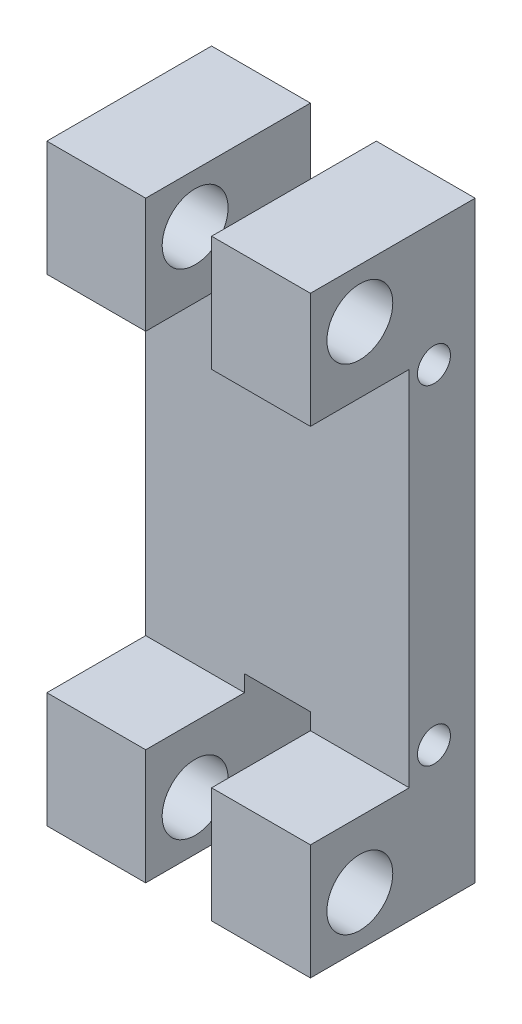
ISO-10303-21;
HEADER;
FILE_DESCRIPTION(('STEP AP214'),'2;1');
FILE_NAME('part.step','',(''),(''),'','','');
FILE_SCHEMA(('AUTOMOTIVE_DESIGN { 1 0 10303 214 1 1 1 1 }'));
ENDSEC;
DATA;
#1=APPLICATION_CONTEXT('core data for automotive mechanical design processes');
#2=APPLICATION_PROTOCOL_DEFINITION('international standard','automotive_design',2000,#1);
#3=PRODUCT_CONTEXT('',#1,'mechanical');
#4=PRODUCT('Part','Part','',(#3));
#5=PRODUCT_RELATED_PRODUCT_CATEGORY('part','',(#4));
#6=PRODUCT_DEFINITION_FORMATION('','',#4);
#7=PRODUCT_DEFINITION_CONTEXT('part definition',#1,'design');
#8=PRODUCT_DEFINITION('design','',#6,#7);
#9=PRODUCT_DEFINITION_SHAPE('','',#8);
#10=(LENGTH_UNIT() NAMED_UNIT(*) SI_UNIT(.MILLI.,.METRE.));
#11=(NAMED_UNIT(*) PLANE_ANGLE_UNIT() SI_UNIT($,.RADIAN.));
#12=(NAMED_UNIT(*) SI_UNIT($,.STERADIAN.) SOLID_ANGLE_UNIT());
#13=UNCERTAINTY_MEASURE_WITH_UNIT(LENGTH_MEASURE(1.E-05),#10,'distance_accuracy_value','');
#14=(GEOMETRIC_REPRESENTATION_CONTEXT(3) GLOBAL_UNCERTAINTY_ASSIGNED_CONTEXT((#13)) GLOBAL_UNIT_ASSIGNED_CONTEXT((#10,
#11,#12)) REPRESENTATION_CONTEXT('',''));
#15=CARTESIAN_POINT('',(0.,0.,0.));
#16=DIRECTION('',(0.,0.,1.));
#17=DIRECTION('',(1.,0.,0.));
#18=AXIS2_PLACEMENT_3D('',#15,#16,#17);
#19=CARTESIAN_POINT('',(0.,0.,15.875));
#20=DIRECTION('',(0.,0.,-1.));
#21=DIRECTION('',(-1.,0.,0.));
#22=AXIS2_PLACEMENT_3D('',#19,#20,#21);
#23=PLANE('',#22);
#24=DIRECTION('',(1.,0.,0.));
#25=VECTOR('',#24,1.);
#26=CARTESIAN_POINT('',(-25.4,-57.15,15.875));
#27=LINE('',#26,#25);
#28=CARTESIAN_POINT('',(-25.4,-57.15,15.875));
#29=VERTEX_POINT('',#28);
#30=CARTESIAN_POINT('',(-6.35000000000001,-57.15,15.875));
#31=VERTEX_POINT('',#30);
#32=EDGE_CURVE('E302',#29,#31,#27,.T.);
#33=ORIENTED_EDGE('',*,*,#32,.T.);
#34=DIRECTION('',(0.,1.,0.));
#35=VECTOR('',#34,1.);
#36=CARTESIAN_POINT('',(-6.35000000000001,-31.75,15.875));
#37=LINE('',#36,#35);
#38=CARTESIAN_POINT('',(-6.35000000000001,-34.925,15.875));
#39=VERTEX_POINT('',#38);
#40=EDGE_CURVE('E195',#31,#39,#37,.T.);
#41=ORIENTED_EDGE('',*,*,#40,.T.);
#42=DIRECTION('',(-1.,0.,0.));
#43=VECTOR('',#42,1.);
#44=CARTESIAN_POINT('',(0.,-34.925,15.875));
#45=LINE('',#44,#43);
#46=CARTESIAN_POINT('',(-25.4,-34.925,15.875));
#47=VERTEX_POINT('',#46);
#48=EDGE_CURVE('E332',#39,#47,#45,.T.);
#49=ORIENTED_EDGE('',*,*,#48,.T.);
#50=DIRECTION('',(0.,-1.,0.));
#51=VECTOR('',#50,1.);
#52=CARTESIAN_POINT('',(-25.4,-57.15,15.875));
#53=LINE('',#52,#51);
#54=EDGE_CURVE('E297',#47,#29,#53,.T.);
#55=ORIENTED_EDGE('',*,*,#54,.T.);
#56=EDGE_LOOP('',(#33,#41,#49,#55));
#57=FACE_BOUND('',#56,.T.);
#58=ADVANCED_FACE('F35',(#57),#23,.F.);
#59=CARTESIAN_POINT('',(-25.4,-57.15,15.875));
#60=DIRECTION('',(0.,1.,0.));
#61=DIRECTION('',(0.,0.,1.));
#62=AXIS2_PLACEMENT_3D('',#59,#60,#61);
#63=PLANE('',#62);
#64=DIRECTION('',(1.,0.,0.));
#65=VECTOR('',#64,1.);
#66=CARTESIAN_POINT('',(-25.4,-57.15,-15.875));
#67=LINE('',#66,#65);
#68=CARTESIAN_POINT('',(-25.4,-57.15,-15.875));
#69=VERTEX_POINT('',#68);
#70=CARTESIAN_POINT('',(-6.35000000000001,-57.15,-15.875));
#71=VERTEX_POINT('',#70);
#72=EDGE_CURVE('E315',#69,#71,#67,.T.);
#73=ORIENTED_EDGE('',*,*,#72,.T.);
#74=DIRECTION('',(0.,0.,1.));
#75=VECTOR('',#74,1.);
#76=CARTESIAN_POINT('',(-6.35000000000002,-57.15,15.875));
#77=LINE('',#76,#75);
#78=EDGE_CURVE('E177',#71,#31,#77,.T.);
#79=ORIENTED_EDGE('',*,*,#78,.T.);
#80=ORIENTED_EDGE('',*,*,#32,.F.);
#81=DIRECTION('',(0.,0.,-1.));
#82=VECTOR('',#81,1.);
#83=CARTESIAN_POINT('',(-25.4,-57.15,15.875));
#84=LINE('',#83,#82);
#85=EDGE_CURVE('E319',#29,#69,#84,.T.);
#86=ORIENTED_EDGE('',*,*,#85,.T.);
#87=EDGE_LOOP('',(#73,#79,#80,#86));
#88=FACE_BOUND('',#87,.T.);
#89=ADVANCED_FACE('F460',(#88),#63,.F.);
#90=CARTESIAN_POINT('',(-25.4,-47.625,6.35));
#91=DIRECTION('',(1.,0.,0.));
#92=DIRECTION('',(0.,0.,-1.));
#93=AXIS2_PLACEMENT_3D('',#90,#91,#92);
#94=CYLINDRICAL_SURFACE('',#93,6.35);
#95=CARTESIAN_POINT('',(-6.35000000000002,-47.625,6.35));
#96=DIRECTION('',(-1.,0.,0.));
#97=DIRECTION('',(0.,-1.,0.));
#98=AXIS2_PLACEMENT_3D('',#95,#96,#97);
#99=CIRCLE('',#98,6.35);
#100=CARTESIAN_POINT('',(-6.35000000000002,-53.975,6.35));
#101=VERTEX_POINT('',#100);
#102=EDGE_CURVE('E212',#101,#101,#99,.F.);
#103=ORIENTED_EDGE('',*,*,#102,.T.);
#104=EDGE_LOOP('',(#103));
#105=FACE_BOUND('',#104,.T.);
#106=CARTESIAN_POINT('',(-25.4,-47.625,6.35));
#107=DIRECTION('',(1.,0.,0.));
#108=DIRECTION('',(0.,0.,-1.));
#109=AXIS2_PLACEMENT_3D('',#106,#107,#108);
#110=CIRCLE('',#109,6.35);
#111=CARTESIAN_POINT('',(-25.4,-47.625,0.));
#112=VERTEX_POINT('',#111);
#113=EDGE_CURVE('E277',#112,#112,#110,.T.);
#114=ORIENTED_EDGE('',*,*,#113,.F.);
#115=EDGE_LOOP('',(#114));
#116=FACE_BOUND('',#115,.T.);
#117=ADVANCED_FACE('F464',(#105,#116),#94,.F.);
#118=CARTESIAN_POINT('',(-25.4,-34.925,34.925));
#119=DIRECTION('',(0.,-1.,0.));
#120=DIRECTION('',(0.,0.,-1.));
#121=AXIS2_PLACEMENT_3D('',#118,#119,#120);
#122=PLANE('',#121);
#123=ORIENTED_EDGE('',*,*,#48,.F.);
#124=DIRECTION('',(0.,0.,-1.));
#125=VECTOR('',#124,1.);
#126=CARTESIAN_POINT('',(-6.35000000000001,-34.925,34.925));
#127=LINE('',#126,#125);
#128=CARTESIAN_POINT('',(-6.35000000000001,-34.925,-3.175));
#129=VERTEX_POINT('',#128);
#130=EDGE_CURVE('E209',#39,#129,#127,.T.);
#131=ORIENTED_EDGE('',*,*,#130,.T.);
#132=DIRECTION('',(1.,0.,0.));
#133=VECTOR('',#132,1.);
#134=CARTESIAN_POINT('',(-25.4,-34.925,-3.175));
#135=LINE('',#134,#133);
#136=CARTESIAN_POINT('',(-25.4,-34.925,-3.175));
#137=VERTEX_POINT('',#136);
#138=EDGE_CURVE('E269',#137,#129,#135,.T.);
#139=ORIENTED_EDGE('',*,*,#138,.F.);
#140=DIRECTION('',(0.,0.,-1.));
#141=VECTOR('',#140,1.);
#142=CARTESIAN_POINT('',(-25.4,-34.925,34.925));
#143=LINE('',#142,#141);
#144=EDGE_CURVE('E258',#47,#137,#143,.T.);
#145=ORIENTED_EDGE('',*,*,#144,.F.);
#146=EDGE_LOOP('',(#123,#131,#139,#145));
#147=FACE_BOUND('',#146,.T.);
#148=ADVANCED_FACE('F390',(#147),#122,.F.);
#149=CARTESIAN_POINT('',(-25.4,57.15,15.875));
#150=DIRECTION('',(0.,-1.,0.));
#151=DIRECTION('',(0.,0.,-1.));
#152=AXIS2_PLACEMENT_3D('',#149,#150,#151);
#153=PLANE('',#152);
#154=DIRECTION('',(-1.,0.,0.));
#155=VECTOR('',#154,1.);
#156=CARTESIAN_POINT('',(-25.4,57.15,15.875));
#157=LINE('',#156,#155);
#158=CARTESIAN_POINT('',(-6.35,57.15,15.875));
#159=VERTEX_POINT('',#158);
#160=CARTESIAN_POINT('',(-25.4,57.15,15.875));
#161=VERTEX_POINT('',#160);
#162=EDGE_CURVE('E292',#159,#161,#157,.T.);
#163=ORIENTED_EDGE('',*,*,#162,.F.);
#164=DIRECTION('',(0.,0.,-1.));
#165=VECTOR('',#164,1.);
#166=CARTESIAN_POINT('',(-6.35,57.15,15.875));
#167=LINE('',#166,#165);
#168=CARTESIAN_POINT('',(-6.35,57.15,-15.875));
#169=VERTEX_POINT('',#168);
#170=EDGE_CURVE('E247',#159,#169,#167,.T.);
#171=ORIENTED_EDGE('',*,*,#170,.T.);
#172=DIRECTION('',(-1.,0.,0.));
#173=VECTOR('',#172,1.);
#174=CARTESIAN_POINT('',(-25.4,57.15,-15.875));
#175=LINE('',#174,#173);
#176=CARTESIAN_POINT('',(-25.4,57.15,-15.875));
#177=VERTEX_POINT('',#176);
#178=EDGE_CURVE('E308',#169,#177,#175,.T.);
#179=ORIENTED_EDGE('',*,*,#178,.T.);
#180=DIRECTION('',(0.,0.,-1.));
#181=VECTOR('',#180,1.);
#182=CARTESIAN_POINT('',(-25.4,57.15,15.875));
#183=LINE('',#182,#181);
#184=EDGE_CURVE('E322',#161,#177,#183,.T.);
#185=ORIENTED_EDGE('',*,*,#184,.F.);
#186=EDGE_LOOP('',(#163,#171,#179,#185));
#187=FACE_BOUND('',#186,.T.);
#188=ADVANCED_FACE('F452',(#187),#153,.F.);
#189=DIRECTION('',(1.,0.,0.));
#190=VECTOR('',#189,1.);
#191=CARTESIAN_POINT('',(0.,34.925,15.875));
#192=LINE('',#191,#190);
#193=CARTESIAN_POINT('',(-25.4,34.925,15.875));
#194=VERTEX_POINT('',#193);
#195=CARTESIAN_POINT('',(-6.35,34.925,15.875));
#196=VERTEX_POINT('',#195);
#197=EDGE_CURVE('E329',#194,#196,#192,.T.);
#198=ORIENTED_EDGE('',*,*,#197,.T.);
#199=DIRECTION('',(0.,1.,0.));
#200=VECTOR('',#199,1.);
#201=CARTESIAN_POINT('',(-6.35,31.75,15.875));
#202=LINE('',#201,#200);
#203=EDGE_CURVE('E217',#196,#159,#202,.T.);
#204=ORIENTED_EDGE('',*,*,#203,.T.);
#205=ORIENTED_EDGE('',*,*,#162,.T.);
#206=EDGE_CURVE('E298',#161,#194,#53,.T.);
#207=ORIENTED_EDGE('',*,*,#206,.T.);
#208=EDGE_LOOP('',(#198,#204,#205,#207));
#209=FACE_BOUND('',#208,.T.);
#210=ADVANCED_FACE('F442',(#209),#23,.F.);
#211=CARTESIAN_POINT('',(-25.4,47.625,6.35));
#212=DIRECTION('',(1.,0.,0.));
#213=DIRECTION('',(0.,0.,-1.));
#214=AXIS2_PLACEMENT_3D('',#211,#212,#213);
#215=CYLINDRICAL_SURFACE('',#214,6.35);
#216=CARTESIAN_POINT('',(-6.35,47.625,6.35));
#217=DIRECTION('',(-1.,0.,0.));
#218=DIRECTION('',(0.,0.,1.));
#219=AXIS2_PLACEMENT_3D('',#216,#217,#218);
#220=CIRCLE('',#219,6.35);
#221=CARTESIAN_POINT('',(-6.35,47.625,12.7));
#222=VERTEX_POINT('',#221);
#223=EDGE_CURVE('E244',#222,#222,#220,.F.);
#224=ORIENTED_EDGE('',*,*,#223,.T.);
#225=EDGE_LOOP('',(#224));
#226=FACE_BOUND('',#225,.T.);
#227=CARTESIAN_POINT('',(-25.4,47.625,6.35));
#228=DIRECTION('',(1.,0.,0.));
#229=DIRECTION('',(0.,0.,-1.));
#230=AXIS2_PLACEMENT_3D('',#227,#228,#229);
#231=CIRCLE('',#230,6.35);
#232=CARTESIAN_POINT('',(-25.4,47.625,0.));
#233=VERTEX_POINT('',#232);
#234=EDGE_CURVE('E283',#233,#233,#231,.T.);
#235=ORIENTED_EDGE('',*,*,#234,.F.);
#236=EDGE_LOOP('',(#235));
#237=FACE_BOUND('',#236,.T.);
#238=ADVANCED_FACE('F440',(#226,#237),#215,.F.);
#239=CARTESIAN_POINT('',(-25.4,34.925,34.925));
#240=DIRECTION('',(0.,1.,0.));
#241=DIRECTION('',(0.,0.,1.));
#242=AXIS2_PLACEMENT_3D('',#239,#240,#241);
#243=PLANE('',#242);
#244=DIRECTION('',(1.,0.,0.));
#245=VECTOR('',#244,1.);
#246=CARTESIAN_POINT('',(-25.4,34.925,-3.175));
#247=LINE('',#246,#245);
#248=CARTESIAN_POINT('',(-25.4,34.925,-3.175));
#249=VERTEX_POINT('',#248);
#250=CARTESIAN_POINT('',(-6.35,34.925,-3.175));
#251=VERTEX_POINT('',#250);
#252=EDGE_CURVE('E274',#249,#251,#247,.T.);
#253=ORIENTED_EDGE('',*,*,#252,.T.);
#254=DIRECTION('',(0.,0.,1.));
#255=VECTOR('',#254,1.);
#256=CARTESIAN_POINT('',(-6.35,34.925,34.925));
#257=LINE('',#256,#255);
#258=EDGE_CURVE('E241',#251,#196,#257,.T.);
#259=ORIENTED_EDGE('',*,*,#258,.T.);
#260=ORIENTED_EDGE('',*,*,#197,.F.);
#261=DIRECTION('',(0.,0.,1.));
#262=VECTOR('',#261,1.);
#263=CARTESIAN_POINT('',(-25.4,34.925,34.925));
#264=LINE('',#263,#262);
#265=EDGE_CURVE('E254',#249,#194,#264,.T.);
#266=ORIENTED_EDGE('',*,*,#265,.F.);
#267=EDGE_LOOP('',(#253,#259,#260,#266));
#268=FACE_BOUND('',#267,.T.);
#269=ADVANCED_FACE('F382',(#268),#243,.F.);
#270=CARTESIAN_POINT('',(25.4,-34.925,15.875));
#271=VERTEX_POINT('',#270);
#272=CARTESIAN_POINT('',(6.34999999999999,-34.925,15.875));
#273=VERTEX_POINT('',#272);
#274=EDGE_CURVE('E333',#271,#273,#45,.T.);
#275=ORIENTED_EDGE('',*,*,#274,.T.);
#276=DIRECTION('',(0.,-1.,0.));
#277=VECTOR('',#276,1.);
#278=CARTESIAN_POINT('',(6.34999999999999,-31.75,15.875));
#279=LINE('',#278,#277);
#280=CARTESIAN_POINT('',(6.34999999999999,-57.15,15.875));
#281=VERTEX_POINT('',#280);
#282=EDGE_CURVE('E189',#273,#281,#279,.T.);
#283=ORIENTED_EDGE('',*,*,#282,.T.);
#284=CARTESIAN_POINT('',(25.4,-57.15,15.875));
#285=VERTEX_POINT('',#284);
#286=EDGE_CURVE('E301',#281,#285,#27,.T.);
#287=ORIENTED_EDGE('',*,*,#286,.T.);
#288=DIRECTION('',(0.,1.,0.));
#289=VECTOR('',#288,1.);
#290=CARTESIAN_POINT('',(25.4,-57.15,15.875));
#291=LINE('',#290,#289);
#292=EDGE_CURVE('E289',#285,#271,#291,.T.);
#293=ORIENTED_EDGE('',*,*,#292,.T.);
#294=EDGE_LOOP('',(#275,#283,#287,#293));
#295=FACE_BOUND('',#294,.T.);
#296=ADVANCED_FACE('F450',(#295),#23,.F.);
#297=CARTESIAN_POINT('',(25.4,-57.15,15.875));
#298=DIRECTION('',(-1.,0.,0.));
#299=DIRECTION('',(0.,0.,1.));
#300=AXIS2_PLACEMENT_3D('',#297,#298,#299);
#301=PLANE('',#300);
#302=CARTESIAN_POINT('',(25.4,-30.1624999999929,-7.9375097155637));
#303=DIRECTION('',(1.,0.,0.));
#304=DIRECTION('',(0.,0.,-1.));
#305=AXIS2_PLACEMENT_3D('',#302,#303,#304);
#306=CIRCLE('',#305,3.17500000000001);
#307=CARTESIAN_POINT('',(25.4,-30.1624999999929,-11.1125097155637));
#308=VERTEX_POINT('',#307);
#309=EDGE_CURVE('E403',#308,#308,#306,.T.);
#310=ORIENTED_EDGE('',*,*,#309,.F.);
#311=EDGE_LOOP('',(#310));
#312=FACE_BOUND('',#311,.T.);
#313=CARTESIAN_POINT('',(25.4,33.3375000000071,-7.93750971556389));
#314=DIRECTION('',(1.,0.,0.));
#315=DIRECTION('',(0.,0.,-1.));
#316=AXIS2_PLACEMENT_3D('',#313,#314,#315);
#317=CIRCLE('',#316,3.17500000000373);
#318=CARTESIAN_POINT('',(25.4,33.3375000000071,-11.1125097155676));
#319=VERTEX_POINT('',#318);
#320=EDGE_CURVE('E397',#319,#319,#317,.T.);
#321=ORIENTED_EDGE('',*,*,#320,.F.);
#322=EDGE_LOOP('',(#321));
#323=FACE_BOUND('',#322,.T.);
#324=CARTESIAN_POINT('',(25.4,-47.625,6.35));
#325=DIRECTION('',(1.,0.,0.));
#326=DIRECTION('',(0.,0.,-1.));
#327=AXIS2_PLACEMENT_3D('',#324,#325,#326);
#328=CIRCLE('',#327,6.35);
#329=CARTESIAN_POINT('',(25.4,-47.625,0.));
#330=VERTEX_POINT('',#329);
#331=EDGE_CURVE('E272',#330,#330,#328,.T.);
#332=ORIENTED_EDGE('',*,*,#331,.F.);
#333=EDGE_LOOP('',(#332));
#334=FACE_BOUND('',#333,.T.);
#335=CARTESIAN_POINT('',(25.4,47.625,6.35));
#336=DIRECTION('',(1.,0.,0.));
#337=DIRECTION('',(0.,0.,-1.));
#338=AXIS2_PLACEMENT_3D('',#335,#336,#337);
#339=CIRCLE('',#338,6.35);
#340=CARTESIAN_POINT('',(25.4,47.625,0.));
#341=VERTEX_POINT('',#340);
#342=EDGE_CURVE('E280',#341,#341,#339,.T.);
#343=ORIENTED_EDGE('',*,*,#342,.F.);
#344=EDGE_LOOP('',(#343));
#345=FACE_BOUND('',#344,.T.);
#346=DIRECTION('',(0.,1.,0.));
#347=VECTOR('',#346,1.);
#348=CARTESIAN_POINT('',(25.4,-34.925,-3.175));
#349=LINE('',#348,#347);
#350=CARTESIAN_POINT('',(25.4,-34.925,-3.175));
#351=VERTEX_POINT('',#350);
#352=CARTESIAN_POINT('',(25.4,34.925,-3.175));
#353=VERTEX_POINT('',#352);
#354=EDGE_CURVE('E250',#351,#353,#349,.T.);
#355=ORIENTED_EDGE('',*,*,#354,.F.);
#356=DIRECTION('',(0.,0.,-1.));
#357=VECTOR('',#356,1.);
#358=CARTESIAN_POINT('',(25.4,-34.925,34.925));
#359=LINE('',#358,#357);
#360=EDGE_CURVE('E255',#271,#351,#359,.T.);
#361=ORIENTED_EDGE('',*,*,#360,.F.);
#362=ORIENTED_EDGE('',*,*,#292,.F.);
#363=DIRECTION('',(0.,0.,-1.));
#364=VECTOR('',#363,1.);
#365=CARTESIAN_POINT('',(25.4,-57.15,15.875));
#366=LINE('',#365,#364);
#367=CARTESIAN_POINT('',(25.4,-57.15,-15.875));
#368=VERTEX_POINT('',#367);
#369=EDGE_CURVE('E305',#285,#368,#366,.T.);
#370=ORIENTED_EDGE('',*,*,#369,.T.);
#371=DIRECTION('',(0.,1.,0.));
#372=VECTOR('',#371,1.);
#373=CARTESIAN_POINT('',(25.4,-57.15,-15.875));
#374=LINE('',#373,#372);
#375=CARTESIAN_POINT('',(25.4,57.15,-15.875));
#376=VERTEX_POINT('',#375);
#377=EDGE_CURVE('E286',#368,#376,#374,.T.);
#378=ORIENTED_EDGE('',*,*,#377,.T.);
#379=DIRECTION('',(0.,0.,-1.));
#380=VECTOR('',#379,1.);
#381=CARTESIAN_POINT('',(25.4,57.15,15.875));
#382=LINE('',#381,#380);
#383=CARTESIAN_POINT('',(25.4,57.15,15.875));
#384=VERTEX_POINT('',#383);
#385=EDGE_CURVE('E325',#384,#376,#382,.T.);
#386=ORIENTED_EDGE('',*,*,#385,.F.);
#387=CARTESIAN_POINT('',(25.4,34.925,15.875));
#388=VERTEX_POINT('',#387);
#389=EDGE_CURVE('E293',#388,#384,#291,.T.);
#390=ORIENTED_EDGE('',*,*,#389,.F.);
#391=DIRECTION('',(0.,0.,1.));
#392=VECTOR('',#391,1.);
#393=CARTESIAN_POINT('',(25.4,34.925,34.925));
#394=LINE('',#393,#392);
#395=EDGE_CURVE('E264',#353,#388,#394,.T.);
#396=ORIENTED_EDGE('',*,*,#395,.F.);
#397=EDGE_LOOP('',(#355,#361,#362,#370,#378,#386,#390,#396));
#398=FACE_BOUND('',#397,.T.);
#399=ADVANCED_FACE('F37',(#312,#323,#334,#345,#398),#301,.F.);
#400=CARTESIAN_POINT('',(6.35,57.15,-15.875));
#401=VERTEX_POINT('',#400);
#402=EDGE_CURVE('E309',#376,#401,#175,.T.);
#403=ORIENTED_EDGE('',*,*,#402,.T.);
#404=DIRECTION('',(0.,0.,1.));
#405=VECTOR('',#404,1.);
#406=CARTESIAN_POINT('',(6.35,57.15,15.875));
#407=LINE('',#406,#405);
#408=CARTESIAN_POINT('',(6.35,57.15,15.875));
#409=VERTEX_POINT('',#408);
#410=EDGE_CURVE('E238',#401,#409,#407,.T.);
#411=ORIENTED_EDGE('',*,*,#410,.T.);
#412=EDGE_CURVE('E294',#384,#409,#157,.T.);
#413=ORIENTED_EDGE('',*,*,#412,.F.);
#414=ORIENTED_EDGE('',*,*,#385,.T.);
#415=EDGE_LOOP('',(#403,#411,#413,#414));
#416=FACE_BOUND('',#415,.T.);
#417=ADVANCED_FACE('F368',(#416),#153,.F.);
#418=CARTESIAN_POINT('',(-25.4,-57.15,15.875));
#419=DIRECTION('',(1.,0.,0.));
#420=DIRECTION('',(0.,0.,-1.));
#421=AXIS2_PLACEMENT_3D('',#418,#419,#420);
#422=PLANE('',#421);
#423=CARTESIAN_POINT('',(-25.4,-26.9874999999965,-7.93750000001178));
#424=DIRECTION('',(-1.,0.,0.));
#425=DIRECTION('',(0.,0.,1.));
#426=AXIS2_PLACEMENT_3D('',#423,#424,#425);
#427=CIRCLE('',#426,3.17500000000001);
#428=CARTESIAN_POINT('',(-25.4,-26.9874999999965,-4.76250000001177));
#429=VERTEX_POINT('',#428);
#430=EDGE_CURVE('E415',#429,#429,#427,.T.);
#431=ORIENTED_EDGE('',*,*,#430,.F.);
#432=EDGE_LOOP('',(#431));
#433=FACE_BOUND('',#432,.T.);
#434=CARTESIAN_POINT('',(-25.4,36.5125000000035,-7.9375000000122));
#435=DIRECTION('',(-1.,0.,0.));
#436=DIRECTION('',(0.,0.,1.));
#437=AXIS2_PLACEMENT_3D('',#434,#435,#436);
#438=CIRCLE('',#437,3.17500000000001);
#439=CARTESIAN_POINT('',(-25.4,36.5125000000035,-4.76250000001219));
#440=VERTEX_POINT('',#439);
#441=EDGE_CURVE('E409',#440,#440,#438,.T.);
#442=ORIENTED_EDGE('',*,*,#441,.F.);
#443=EDGE_LOOP('',(#442));
#444=FACE_BOUND('',#443,.T.);
#445=ORIENTED_EDGE('',*,*,#113,.T.);
#446=EDGE_LOOP('',(#445));
#447=FACE_BOUND('',#446,.T.);
#448=ORIENTED_EDGE('',*,*,#234,.T.);
#449=EDGE_LOOP('',(#448));
#450=FACE_BOUND('',#449,.T.);
#451=ORIENTED_EDGE('',*,*,#54,.F.);
#452=ORIENTED_EDGE('',*,*,#144,.T.);
#453=DIRECTION('',(0.,1.,0.));
#454=VECTOR('',#453,1.);
#455=CARTESIAN_POINT('',(-25.4,-34.925,-3.175));
#456=LINE('',#455,#454);
#457=EDGE_CURVE('E251',#137,#249,#456,.T.);
#458=ORIENTED_EDGE('',*,*,#457,.T.);
#459=ORIENTED_EDGE('',*,*,#265,.T.);
#460=ORIENTED_EDGE('',*,*,#206,.F.);
#461=ORIENTED_EDGE('',*,*,#184,.T.);
#462=DIRECTION('',(0.,-1.,0.));
#463=VECTOR('',#462,1.);
#464=CARTESIAN_POINT('',(-25.4,-57.15,-15.875));
#465=LINE('',#464,#463);
#466=EDGE_CURVE('E312',#177,#69,#465,.T.);
#467=ORIENTED_EDGE('',*,*,#466,.T.);
#468=ORIENTED_EDGE('',*,*,#85,.F.);
#469=EDGE_LOOP('',(#451,#452,#458,#459,#460,#461,#467,#468));
#470=FACE_BOUND('',#469,.T.);
#471=ADVANCED_FACE('F386',(#433,#444,#447,#450,#470),#422,.F.);
#472=ORIENTED_EDGE('',*,*,#286,.F.);
#473=DIRECTION('',(0.,0.,-1.));
#474=VECTOR('',#473,1.);
#475=CARTESIAN_POINT('',(6.34999999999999,-57.15,15.875));
#476=LINE('',#475,#474);
#477=CARTESIAN_POINT('',(6.34999999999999,-57.15,-15.875));
#478=VERTEX_POINT('',#477);
#479=EDGE_CURVE('E206',#281,#478,#476,.T.);
#480=ORIENTED_EDGE('',*,*,#479,.T.);
#481=EDGE_CURVE('E314',#478,#368,#67,.T.);
#482=ORIENTED_EDGE('',*,*,#481,.T.);
#483=ORIENTED_EDGE('',*,*,#369,.F.);
#484=EDGE_LOOP('',(#472,#480,#482,#483));
#485=FACE_BOUND('',#484,.T.);
#486=ADVANCED_FACE('F432',(#485),#63,.F.);
#487=ORIENTED_EDGE('',*,*,#412,.T.);
#488=DIRECTION('',(0.,-1.,0.));
#489=VECTOR('',#488,1.);
#490=CARTESIAN_POINT('',(6.35,31.75,15.875));
#491=LINE('',#490,#489);
#492=CARTESIAN_POINT('',(6.35,34.925,15.875));
#493=VERTEX_POINT('',#492);
#494=EDGE_CURVE('E220',#409,#493,#491,.T.);
#495=ORIENTED_EDGE('',*,*,#494,.T.);
#496=EDGE_CURVE('E328',#493,#388,#192,.T.);
#497=ORIENTED_EDGE('',*,*,#496,.T.);
#498=ORIENTED_EDGE('',*,*,#389,.T.);
#499=EDGE_LOOP('',(#487,#495,#497,#498));
#500=FACE_BOUND('',#499,.T.);
#501=ADVANCED_FACE('F364',(#500),#23,.F.);
#502=CARTESIAN_POINT('',(0.,0.,-15.875));
#503=DIRECTION('',(0.,0.,-1.));
#504=DIRECTION('',(-1.,0.,0.));
#505=AXIS2_PLACEMENT_3D('',#502,#503,#504);
#506=PLANE('',#505);
#507=DIRECTION('',(0.,1.,0.));
#508=VECTOR('',#507,1.);
#509=CARTESIAN_POINT('',(-6.35000000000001,-31.75,-15.875));
#510=LINE('',#509,#508);
#511=CARTESIAN_POINT('',(-6.35000000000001,-31.75,-15.875));
#512=VERTEX_POINT('',#511);
#513=EDGE_CURVE('E172',#71,#512,#510,.T.);
#514=ORIENTED_EDGE('',*,*,#513,.F.);
#515=ORIENTED_EDGE('',*,*,#72,.F.);
#516=ORIENTED_EDGE('',*,*,#466,.F.);
#517=ORIENTED_EDGE('',*,*,#178,.F.);
#518=DIRECTION('',(0.,1.,0.));
#519=VECTOR('',#518,1.);
#520=CARTESIAN_POINT('',(-6.35,31.75,-15.875));
#521=LINE('',#520,#519);
#522=CARTESIAN_POINT('',(-6.35,31.75,-15.875));
#523=VERTEX_POINT('',#522);
#524=EDGE_CURVE('E216',#523,#169,#521,.T.);
#525=ORIENTED_EDGE('',*,*,#524,.F.);
#526=DIRECTION('',(-1.,0.,0.));
#527=VECTOR('',#526,1.);
#528=CARTESIAN_POINT('',(6.35,31.75,-15.875));
#529=LINE('',#528,#527);
#530=CARTESIAN_POINT('',(6.35,31.75,-15.875));
#531=VERTEX_POINT('',#530);
#532=EDGE_CURVE('E221',#531,#523,#529,.T.);
#533=ORIENTED_EDGE('',*,*,#532,.F.);
#534=DIRECTION('',(0.,-1.,0.));
#535=VECTOR('',#534,1.);
#536=CARTESIAN_POINT('',(6.35,31.75,-15.875));
#537=LINE('',#536,#535);
#538=EDGE_CURVE('E225',#401,#531,#537,.T.);
#539=ORIENTED_EDGE('',*,*,#538,.F.);
#540=ORIENTED_EDGE('',*,*,#402,.F.);
#541=ORIENTED_EDGE('',*,*,#377,.F.);
#542=ORIENTED_EDGE('',*,*,#481,.F.);
#543=DIRECTION('',(0.,-1.,0.));
#544=VECTOR('',#543,1.);
#545=CARTESIAN_POINT('',(6.34999999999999,-31.75,-15.875));
#546=LINE('',#545,#544);
#547=CARTESIAN_POINT('',(6.34999999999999,-31.75,-15.875));
#548=VERTEX_POINT('',#547);
#549=EDGE_CURVE('E193',#548,#478,#546,.T.);
#550=ORIENTED_EDGE('',*,*,#549,.F.);
#551=DIRECTION('',(1.,0.,0.));
#552=VECTOR('',#551,1.);
#553=CARTESIAN_POINT('',(6.34999999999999,-31.75,-15.875));
#554=LINE('',#553,#552);
#555=EDGE_CURVE('E182',#512,#548,#554,.T.);
#556=ORIENTED_EDGE('',*,*,#555,.F.);
#557=EDGE_LOOP('',(#514,#515,#516,#517,#525,#533,#539,#540,#541,#542,#550,#556));
#558=FACE_BOUND('',#557,.T.);
#559=ADVANCED_FACE('F191',(#558),#506,.T.);
#560=CARTESIAN_POINT('',(6.35,47.625,6.35));
#561=DIRECTION('',(1.,0.,0.));
#562=DIRECTION('',(0.,0.,-1.));
#563=AXIS2_PLACEMENT_3D('',#560,#561,#562);
#564=CIRCLE('',#563,6.35);
#565=CARTESIAN_POINT('',(6.35,47.625,0.));
#566=VERTEX_POINT('',#565);
#567=EDGE_CURVE('E235',#566,#566,#564,.F.);
#568=ORIENTED_EDGE('',*,*,#567,.T.);
#569=EDGE_LOOP('',(#568));
#570=FACE_BOUND('',#569,.T.);
#571=ORIENTED_EDGE('',*,*,#342,.T.);
#572=EDGE_LOOP('',(#571));
#573=FACE_BOUND('',#572,.T.);
#574=ADVANCED_FACE('F445',(#570,#573),#215,.F.);
#575=CARTESIAN_POINT('',(6.34999999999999,-47.625,6.35));
#576=DIRECTION('',(1.,0.,0.));
#577=DIRECTION('',(0.,1.,0.));
#578=AXIS2_PLACEMENT_3D('',#575,#576,#577);
#579=CIRCLE('',#578,6.35);
#580=CARTESIAN_POINT('',(6.34999999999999,-41.275,6.35));
#581=VERTEX_POINT('',#580);
#582=EDGE_CURVE('E203',#581,#581,#579,.F.);
#583=ORIENTED_EDGE('',*,*,#582,.T.);
#584=EDGE_LOOP('',(#583));
#585=FACE_BOUND('',#584,.T.);
#586=ORIENTED_EDGE('',*,*,#331,.T.);
#587=EDGE_LOOP('',(#586));
#588=FACE_BOUND('',#587,.T.);
#589=ADVANCED_FACE('F457',(#585,#588),#94,.F.);
#590=CARTESIAN_POINT('',(6.34999999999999,-34.925,-3.175));
#591=VERTEX_POINT('',#590);
#592=EDGE_CURVE('E273',#591,#351,#135,.T.);
#593=ORIENTED_EDGE('',*,*,#592,.F.);
#594=DIRECTION('',(0.,0.,1.));
#595=VECTOR('',#594,1.);
#596=CARTESIAN_POINT('',(6.34999999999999,-34.925,34.925));
#597=LINE('',#596,#595);
#598=EDGE_CURVE('E199',#591,#273,#597,.T.);
#599=ORIENTED_EDGE('',*,*,#598,.T.);
#600=ORIENTED_EDGE('',*,*,#274,.F.);
#601=ORIENTED_EDGE('',*,*,#360,.T.);
#602=EDGE_LOOP('',(#593,#599,#600,#601));
#603=FACE_BOUND('',#602,.T.);
#604=ADVANCED_FACE('F351',(#603),#122,.F.);
#605=ORIENTED_EDGE('',*,*,#496,.F.);
#606=DIRECTION('',(0.,0.,-1.));
#607=VECTOR('',#606,1.);
#608=CARTESIAN_POINT('',(6.35,34.925,34.925));
#609=LINE('',#608,#607);
#610=CARTESIAN_POINT('',(6.35,34.925,-3.175));
#611=VERTEX_POINT('',#610);
#612=EDGE_CURVE('E231',#493,#611,#609,.T.);
#613=ORIENTED_EDGE('',*,*,#612,.T.);
#614=EDGE_CURVE('E261',#611,#353,#247,.T.);
#615=ORIENTED_EDGE('',*,*,#614,.T.);
#616=ORIENTED_EDGE('',*,*,#395,.T.);
#617=EDGE_LOOP('',(#605,#613,#615,#616));
#618=FACE_BOUND('',#617,.T.);
#619=ADVANCED_FACE('F361',(#618),#243,.F.);
#620=CARTESIAN_POINT('',(-25.4,-34.925,-3.175));
#621=DIRECTION('',(0.,0.,-1.));
#622=DIRECTION('',(-1.,0.,0.));
#623=AXIS2_PLACEMENT_3D('',#620,#621,#622);
#624=PLANE('',#623);
#625=ORIENTED_EDGE('',*,*,#138,.T.);
#626=DIRECTION('',(0.,1.,0.));
#627=VECTOR('',#626,1.);
#628=CARTESIAN_POINT('',(-6.35000000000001,-34.925,-3.175));
#629=LINE('',#628,#627);
#630=CARTESIAN_POINT('',(-6.35000000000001,-31.75,-3.175));
#631=VERTEX_POINT('',#630);
#632=EDGE_CURVE('E11',#129,#631,#629,.T.);
#633=ORIENTED_EDGE('',*,*,#632,.T.);
#634=DIRECTION('',(1.,0.,0.));
#635=VECTOR('',#634,1.);
#636=CARTESIAN_POINT('',(-25.4,-31.75,-3.175));
#637=LINE('',#636,#635);
#638=CARTESIAN_POINT('',(6.34999999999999,-31.75,-3.175));
#639=VERTEX_POINT('',#638);
#640=EDGE_CURVE('E188',#631,#639,#637,.T.);
#641=ORIENTED_EDGE('',*,*,#640,.T.);
#642=DIRECTION('',(0.,-1.,0.));
#643=VECTOR('',#642,1.);
#644=CARTESIAN_POINT('',(6.34999999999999,-34.925,-3.175));
#645=LINE('',#644,#643);
#646=EDGE_CURVE('E43',#639,#591,#645,.T.);
#647=ORIENTED_EDGE('',*,*,#646,.T.);
#648=ORIENTED_EDGE('',*,*,#592,.T.);
#649=ORIENTED_EDGE('',*,*,#354,.T.);
#650=ORIENTED_EDGE('',*,*,#614,.F.);
#651=DIRECTION('',(0.,-1.,0.));
#652=VECTOR('',#651,1.);
#653=CARTESIAN_POINT('',(6.35,-34.925,-3.175));
#654=LINE('',#653,#652);
#655=CARTESIAN_POINT('',(6.35,31.75,-3.175));
#656=VERTEX_POINT('',#655);
#657=EDGE_CURVE('E336',#611,#656,#654,.T.);
#658=ORIENTED_EDGE('',*,*,#657,.T.);
#659=DIRECTION('',(-1.,0.,0.));
#660=VECTOR('',#659,1.);
#661=CARTESIAN_POINT('',(-25.4,31.75,-3.175));
#662=LINE('',#661,#660);
#663=CARTESIAN_POINT('',(-6.35,31.75,-3.175));
#664=VERTEX_POINT('',#663);
#665=EDGE_CURVE('E339',#656,#664,#662,.T.);
#666=ORIENTED_EDGE('',*,*,#665,.T.);
#667=DIRECTION('',(0.,1.,0.));
#668=VECTOR('',#667,1.);
#669=CARTESIAN_POINT('',(-6.35,-34.925,-3.175));
#670=LINE('',#669,#668);
#671=EDGE_CURVE('E342',#664,#251,#670,.T.);
#672=ORIENTED_EDGE('',*,*,#671,.T.);
#673=ORIENTED_EDGE('',*,*,#252,.F.);
#674=ORIENTED_EDGE('',*,*,#457,.F.);
#675=EDGE_LOOP('',(#625,#633,#641,#647,#648,#649,#650,#658,#666,#672,#673,#674));
#676=FACE_BOUND('',#675,.T.);
#677=ADVANCED_FACE('F348',(#676),#624,.F.);
#678=CARTESIAN_POINT('',(-6.35,31.75,15.875));
#679=DIRECTION('',(-1.,0.,0.));
#680=DIRECTION('',(0.,0.,1.));
#681=AXIS2_PLACEMENT_3D('',#678,#679,#680);
#682=PLANE('',#681);
#683=ORIENTED_EDGE('',*,*,#223,.F.);
#684=EDGE_LOOP('',(#683));
#685=FACE_BOUND('',#684,.T.);
#686=ORIENTED_EDGE('',*,*,#203,.F.);
#687=ORIENTED_EDGE('',*,*,#258,.F.);
#688=ORIENTED_EDGE('',*,*,#671,.F.);
#689=DIRECTION('',(0.,0.,-1.));
#690=VECTOR('',#689,1.);
#691=CARTESIAN_POINT('',(-6.35,31.75,15.875));
#692=LINE('',#691,#690);
#693=EDGE_CURVE('E229',#664,#523,#692,.T.);
#694=ORIENTED_EDGE('',*,*,#693,.T.);
#695=ORIENTED_EDGE('',*,*,#524,.T.);
#696=ORIENTED_EDGE('',*,*,#170,.F.);
#697=EDGE_LOOP('',(#686,#687,#688,#694,#695,#696));
#698=FACE_BOUND('',#697,.T.);
#699=ADVANCED_FACE('F499',(#685,#698),#682,.F.);
#700=CARTESIAN_POINT('',(6.35,31.75,15.875));
#701=DIRECTION('',(0.,-1.,0.));
#702=DIRECTION('',(0.,0.,-1.));
#703=AXIS2_PLACEMENT_3D('',#700,#701,#702);
#704=PLANE('',#703);
#705=DIRECTION('',(0.,0.,-1.));
#706=VECTOR('',#705,1.);
#707=CARTESIAN_POINT('',(6.35,31.75,15.875));
#708=LINE('',#707,#706);
#709=EDGE_CURVE('E58',#656,#531,#708,.T.);
#710=ORIENTED_EDGE('',*,*,#709,.T.);
#711=ORIENTED_EDGE('',*,*,#532,.T.);
#712=ORIENTED_EDGE('',*,*,#693,.F.);
#713=ORIENTED_EDGE('',*,*,#665,.F.);
#714=EDGE_LOOP('',(#710,#711,#712,#713));
#715=FACE_BOUND('',#714,.T.);
#716=ADVANCED_FACE('F377',(#715),#704,.F.);
#717=CARTESIAN_POINT('',(6.35,31.75,15.875));
#718=DIRECTION('',(1.,0.,0.));
#719=DIRECTION('',(0.,0.,-1.));
#720=AXIS2_PLACEMENT_3D('',#717,#718,#719);
#721=PLANE('',#720);
#722=ORIENTED_EDGE('',*,*,#567,.F.);
#723=EDGE_LOOP('',(#722));
#724=FACE_BOUND('',#723,.T.);
#725=ORIENTED_EDGE('',*,*,#538,.T.);
#726=ORIENTED_EDGE('',*,*,#709,.F.);
#727=ORIENTED_EDGE('',*,*,#657,.F.);
#728=ORIENTED_EDGE('',*,*,#612,.F.);
#729=ORIENTED_EDGE('',*,*,#494,.F.);
#730=ORIENTED_EDGE('',*,*,#410,.F.);
#731=EDGE_LOOP('',(#725,#726,#727,#728,#729,#730));
#732=FACE_BOUND('',#731,.T.);
#733=ADVANCED_FACE('F362',(#724,#732),#721,.F.);
#734=CARTESIAN_POINT('',(-6.35000000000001,-31.75,15.875));
#735=DIRECTION('',(-1.,0.,0.));
#736=DIRECTION('',(0.,-1.,0.));
#737=AXIS2_PLACEMENT_3D('',#734,#735,#736);
#738=PLANE('',#737);
#739=ORIENTED_EDGE('',*,*,#102,.F.);
#740=EDGE_LOOP('',(#739));
#741=FACE_BOUND('',#740,.T.);
#742=ORIENTED_EDGE('',*,*,#513,.T.);
#743=DIRECTION('',(0.,0.,-1.));
#744=VECTOR('',#743,1.);
#745=CARTESIAN_POINT('',(-6.35000000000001,-31.75,15.875));
#746=LINE('',#745,#744);
#747=EDGE_CURVE('E175',#631,#512,#746,.T.);
#748=ORIENTED_EDGE('',*,*,#747,.F.);
#749=ORIENTED_EDGE('',*,*,#632,.F.);
#750=ORIENTED_EDGE('',*,*,#130,.F.);
#751=ORIENTED_EDGE('',*,*,#40,.F.);
#752=ORIENTED_EDGE('',*,*,#78,.F.);
#753=EDGE_LOOP('',(#742,#748,#749,#750,#751,#752));
#754=FACE_BOUND('',#753,.T.);
#755=ADVANCED_FACE('F174',(#741,#754),#738,.F.);
#756=CARTESIAN_POINT('',(6.34999999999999,-31.75,15.875));
#757=DIRECTION('',(1.,0.,0.));
#758=DIRECTION('',(0.,1.,0.));
#759=AXIS2_PLACEMENT_3D('',#756,#757,#758);
#760=PLANE('',#759);
#761=ORIENTED_EDGE('',*,*,#582,.F.);
#762=EDGE_LOOP('',(#761));
#763=FACE_BOUND('',#762,.T.);
#764=ORIENTED_EDGE('',*,*,#282,.F.);
#765=ORIENTED_EDGE('',*,*,#598,.F.);
#766=ORIENTED_EDGE('',*,*,#646,.F.);
#767=DIRECTION('',(0.,0.,-1.));
#768=VECTOR('',#767,1.);
#769=CARTESIAN_POINT('',(6.34999999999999,-31.75,15.875));
#770=LINE('',#769,#768);
#771=EDGE_CURVE('E50',#639,#548,#770,.T.);
#772=ORIENTED_EDGE('',*,*,#771,.T.);
#773=ORIENTED_EDGE('',*,*,#549,.T.);
#774=ORIENTED_EDGE('',*,*,#479,.F.);
#775=EDGE_LOOP('',(#764,#765,#766,#772,#773,#774));
#776=FACE_BOUND('',#775,.T.);
#777=ADVANCED_FACE('F481',(#763,#776),#760,.F.);
#778=CARTESIAN_POINT('',(6.34999999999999,-31.75,15.875));
#779=DIRECTION('',(0.,1.,0.));
#780=DIRECTION('',(0.,0.,1.));
#781=AXIS2_PLACEMENT_3D('',#778,#779,#780);
#782=PLANE('',#781);
#783=ORIENTED_EDGE('',*,*,#747,.T.);
#784=ORIENTED_EDGE('',*,*,#555,.T.);
#785=ORIENTED_EDGE('',*,*,#771,.F.);
#786=ORIENTED_EDGE('',*,*,#640,.F.);
#787=EDGE_LOOP('',(#783,#784,#785,#786));
#788=FACE_BOUND('',#787,.T.);
#789=ADVANCED_FACE('F185',(#788),#782,.F.);
#790=CARTESIAN_POINT('',(12.7,33.3375000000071,-7.93750971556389));
#791=DIRECTION('',(1.,0.,0.));
#792=DIRECTION('',(0.,0.,-1.));
#793=AXIS2_PLACEMENT_3D('',#790,#791,#792);
#794=CYLINDRICAL_SURFACE('',#793,3.17500000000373);
#795=CARTESIAN_POINT('',(12.7,33.3375000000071,-7.93750971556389));
#796=DIRECTION('',(1.,0.,0.));
#797=DIRECTION('',(0.,0.,-1.));
#798=AXIS2_PLACEMENT_3D('',#795,#796,#797);
#799=CIRCLE('',#798,3.17500000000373);
#800=CARTESIAN_POINT('',(12.7,33.3375000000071,-11.1125097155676));
#801=VERTEX_POINT('',#800);
#802=EDGE_CURVE('E183',#801,#801,#799,.T.);
#803=ORIENTED_EDGE('',*,*,#802,.F.);
#804=EDGE_LOOP('',(#803));
#805=FACE_BOUND('',#804,.T.);
#806=ORIENTED_EDGE('',*,*,#320,.T.);
#807=EDGE_LOOP('',(#806));
#808=FACE_BOUND('',#807,.T.);
#809=ADVANCED_FACE('F489',(#805,#808),#794,.F.);
#810=CARTESIAN_POINT('',(12.7,33.3375000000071,-7.93750971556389));
#811=DIRECTION('',(1.,0.,0.));
#812=DIRECTION('',(0.,0.,-1.));
#813=AXIS2_PLACEMENT_3D('',#810,#811,#812);
#814=PLANE('',#813);
#815=ORIENTED_EDGE('',*,*,#802,.T.);
#816=EDGE_LOOP('',(#815));
#817=FACE_BOUND('',#816,.T.);
#818=ADVANCED_FACE('F632',(#817),#814,.T.);
#819=CARTESIAN_POINT('',(12.7,-30.1624999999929,-7.9375097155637));
#820=DIRECTION('',(1.,0.,0.));
#821=DIRECTION('',(0.,0.,-1.));
#822=AXIS2_PLACEMENT_3D('',#819,#820,#821);
#823=CYLINDRICAL_SURFACE('',#822,3.17500000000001);
#824=CARTESIAN_POINT('',(12.7,-30.1624999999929,-7.9375097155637));
#825=DIRECTION('',(1.,0.,0.));
#826=DIRECTION('',(0.,0.,-1.));
#827=AXIS2_PLACEMENT_3D('',#824,#825,#826);
#828=CIRCLE('',#827,3.17500000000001);
#829=CARTESIAN_POINT('',(12.7,-30.1624999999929,-11.1125097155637));
#830=VERTEX_POINT('',#829);
#831=EDGE_CURVE('E400',#830,#830,#828,.T.);
#832=ORIENTED_EDGE('',*,*,#831,.F.);
#833=EDGE_LOOP('',(#832));
#834=FACE_BOUND('',#833,.T.);
#835=ORIENTED_EDGE('',*,*,#309,.T.);
#836=EDGE_LOOP('',(#835));
#837=FACE_BOUND('',#836,.T.);
#838=ADVANCED_FACE('F641',(#834,#837),#823,.F.);
#839=CARTESIAN_POINT('',(12.7,-30.1624999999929,-7.9375097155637));
#840=DIRECTION('',(1.,0.,0.));
#841=DIRECTION('',(0.,0.,-1.));
#842=AXIS2_PLACEMENT_3D('',#839,#840,#841);
#843=PLANE('',#842);
#844=ORIENTED_EDGE('',*,*,#831,.T.);
#845=EDGE_LOOP('',(#844));
#846=FACE_BOUND('',#845,.T.);
#847=ADVANCED_FACE('F649',(#846),#843,.T.);
#848=CARTESIAN_POINT('',(-12.7,36.5125000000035,-7.9375000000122));
#849=DIRECTION('',(-1.,0.,0.));
#850=DIRECTION('',(0.,0.,1.));
#851=AXIS2_PLACEMENT_3D('',#848,#849,#850);
#852=CYLINDRICAL_SURFACE('',#851,3.17500000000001);
#853=CARTESIAN_POINT('',(-12.7,36.5125000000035,-7.9375000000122));
#854=DIRECTION('',(-1.,0.,0.));
#855=DIRECTION('',(0.,0.,1.));
#856=AXIS2_PLACEMENT_3D('',#853,#854,#855);
#857=CIRCLE('',#856,3.17500000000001);
#858=CARTESIAN_POINT('',(-12.7,36.5125000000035,-4.76250000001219));
#859=VERTEX_POINT('',#858);
#860=EDGE_CURVE('E406',#859,#859,#857,.T.);
#861=ORIENTED_EDGE('',*,*,#860,.F.);
#862=EDGE_LOOP('',(#861));
#863=FACE_BOUND('',#862,.T.);
#864=ORIENTED_EDGE('',*,*,#441,.T.);
#865=EDGE_LOOP('',(#864));
#866=FACE_BOUND('',#865,.T.);
#867=ADVANCED_FACE('F658',(#863,#866),#852,.F.);
#868=CARTESIAN_POINT('',(-12.7,36.5125000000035,-7.9375000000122));
#869=DIRECTION('',(-1.,0.,0.));
#870=DIRECTION('',(0.,0.,1.));
#871=AXIS2_PLACEMENT_3D('',#868,#869,#870);
#872=PLANE('',#871);
#873=ORIENTED_EDGE('',*,*,#860,.T.);
#874=EDGE_LOOP('',(#873));
#875=FACE_BOUND('',#874,.T.);
#876=ADVANCED_FACE('F426',(#875),#872,.T.);
#877=CARTESIAN_POINT('',(-12.7,-26.9874999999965,-7.93750000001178));
#878=DIRECTION('',(-1.,0.,0.));
#879=DIRECTION('',(0.,0.,1.));
#880=AXIS2_PLACEMENT_3D('',#877,#878,#879);
#881=CYLINDRICAL_SURFACE('',#880,3.17500000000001);
#882=CARTESIAN_POINT('',(-12.7,-26.9874999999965,-7.93750000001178));
#883=DIRECTION('',(-1.,0.,0.));
#884=DIRECTION('',(0.,0.,1.));
#885=AXIS2_PLACEMENT_3D('',#882,#883,#884);
#886=CIRCLE('',#885,3.17500000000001);
#887=CARTESIAN_POINT('',(-12.7,-26.9874999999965,-4.76250000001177));
#888=VERTEX_POINT('',#887);
#889=EDGE_CURVE('E412',#888,#888,#886,.T.);
#890=ORIENTED_EDGE('',*,*,#889,.F.);
#891=EDGE_LOOP('',(#890));
#892=FACE_BOUND('',#891,.T.);
#893=ORIENTED_EDGE('',*,*,#430,.T.);
#894=EDGE_LOOP('',(#893));
#895=FACE_BOUND('',#894,.T.);
#896=ADVANCED_FACE('F423',(#892,#895),#881,.F.);
#897=CARTESIAN_POINT('',(-12.7,-26.9874999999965,-7.93750000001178));
#898=DIRECTION('',(-1.,0.,0.));
#899=DIRECTION('',(0.,0.,1.));
#900=AXIS2_PLACEMENT_3D('',#897,#898,#899);
#901=PLANE('',#900);
#902=ORIENTED_EDGE('',*,*,#889,.T.);
#903=EDGE_LOOP('',(#902));
#904=FACE_BOUND('',#903,.T.);
#905=ADVANCED_FACE('F421',(#904),#901,.T.);
#906=CLOSED_SHELL('',(#58,#89,#117,#148,#188,#210,#238,#269,#296,#399,#417,#471,#486,#501,#559,
#574,#589,#604,#619,#677,#699,#716,#733,#755,#777,#789,#809,#818,#838,#847,#867,#876,#896,#905));
#907=MANIFOLD_SOLID_BREP('B2',#906);
#908=ADVANCED_BREP_SHAPE_REPRESENTATION('',(#18,#907),#14);
#909=SHAPE_DEFINITION_REPRESENTATION(#9,#908);
ENDSEC;
END-ISO-10303-21;
